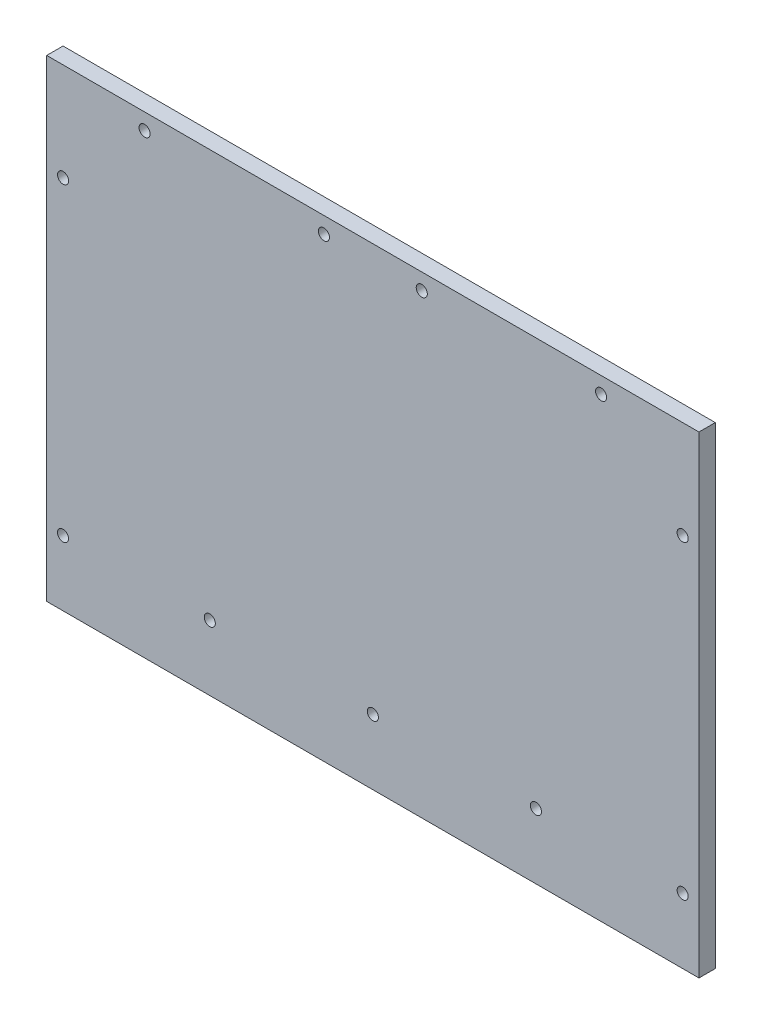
ISO-10303-21;
HEADER;
FILE_DESCRIPTION(('STEP AP214'),'2;1');
FILE_NAME('part.step','',(''),(''),'','','');
FILE_SCHEMA(('AUTOMOTIVE_DESIGN { 1 0 10303 214 1 1 1 1 }'));
ENDSEC;
DATA;
#1=APPLICATION_CONTEXT('core data for automotive mechanical design processes');
#2=APPLICATION_PROTOCOL_DEFINITION('international standard','automotive_design',2000,#1);
#3=PRODUCT_CONTEXT('',#1,'mechanical');
#4=PRODUCT('Part','Part','',(#3));
#5=PRODUCT_RELATED_PRODUCT_CATEGORY('part','',(#4));
#6=PRODUCT_DEFINITION_FORMATION('','',#4);
#7=PRODUCT_DEFINITION_CONTEXT('part definition',#1,'design');
#8=PRODUCT_DEFINITION('design','',#6,#7);
#9=PRODUCT_DEFINITION_SHAPE('','',#8);
#10=(LENGTH_UNIT() NAMED_UNIT(*) SI_UNIT(.MILLI.,.METRE.));
#11=(NAMED_UNIT(*) PLANE_ANGLE_UNIT() SI_UNIT($,.RADIAN.));
#12=(NAMED_UNIT(*) SI_UNIT($,.STERADIAN.) SOLID_ANGLE_UNIT());
#13=UNCERTAINTY_MEASURE_WITH_UNIT(LENGTH_MEASURE(1.E-05),#10,'distance_accuracy_value','');
#14=(GEOMETRIC_REPRESENTATION_CONTEXT(3) GLOBAL_UNCERTAINTY_ASSIGNED_CONTEXT((#13)) GLOBAL_UNIT_ASSIGNED_CONTEXT((#10,
#11,#12)) REPRESENTATION_CONTEXT('',''));
#15=CARTESIAN_POINT('',(0.,0.,0.));
#16=DIRECTION('',(0.,0.,1.));
#17=DIRECTION('',(1.,0.,0.));
#18=AXIS2_PLACEMENT_3D('',#15,#16,#17);
#19=CARTESIAN_POINT('',(0.,0.,0.));
#20=DIRECTION('',(0.,0.,1.));
#21=DIRECTION('',(1.,0.,0.));
#22=AXIS2_PLACEMENT_3D('',#19,#20,#21);
#23=PLANE('',#22);
#24=CARTESIAN_POINT('',(95.,42.5,0.));
#25=DIRECTION('',(0.,0.,-1.));
#26=DIRECTION('',(-1.,0.,0.));
#27=AXIS2_PLACEMENT_3D('',#24,#25,#26);
#28=CIRCLE('',#27,3.3);
#29=CARTESIAN_POINT('',(91.7,42.5,0.));
#30=VERTEX_POINT('',#29);
#31=EDGE_CURVE('E593',#30,#30,#28,.T.);
#32=ORIENTED_EDGE('',*,*,#31,.F.);
#33=EDGE_LOOP('',(#32));
#34=FACE_BOUND('',#33,.T.);
#35=CARTESIAN_POINT('',(-95.,42.5,0.));
#36=DIRECTION('',(0.,0.,-1.));
#37=DIRECTION('',(-1.,0.,0.));
#38=AXIS2_PLACEMENT_3D('',#35,#36,#37);
#39=CIRCLE('',#38,3.3);
#40=CARTESIAN_POINT('',(-98.3,42.5,0.));
#41=VERTEX_POINT('',#40);
#42=EDGE_CURVE('E584',#41,#41,#39,.T.);
#43=ORIENTED_EDGE('',*,*,#42,.F.);
#44=EDGE_LOOP('',(#43));
#45=FACE_BOUND('',#44,.T.);
#46=CARTESIAN_POINT('',(50.,-52.5,0.));
#47=DIRECTION('',(0.,0.,-1.));
#48=DIRECTION('',(-1.,0.,0.));
#49=AXIS2_PLACEMENT_3D('',#46,#47,#48);
#50=CIRCLE('',#49,3.3);
#51=CARTESIAN_POINT('',(46.7,-52.5,0.));
#52=VERTEX_POINT('',#51);
#53=EDGE_CURVE('E574',#52,#52,#50,.T.);
#54=ORIENTED_EDGE('',*,*,#53,.F.);
#55=EDGE_LOOP('',(#54));
#56=FACE_BOUND('',#55,.T.);
#57=CARTESIAN_POINT('',(0.,-52.5,0.));
#58=DIRECTION('',(0.,0.,-1.));
#59=DIRECTION('',(-1.,0.,0.));
#60=AXIS2_PLACEMENT_3D('',#57,#58,#59);
#61=CIRCLE('',#60,3.3);
#62=CARTESIAN_POINT('',(-3.30000000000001,-52.5,0.));
#63=VERTEX_POINT('',#62);
#64=EDGE_CURVE('E156',#63,#63,#61,.T.);
#65=ORIENTED_EDGE('',*,*,#64,.F.);
#66=EDGE_LOOP('',(#65));
#67=FACE_BOUND('',#66,.T.);
#68=CARTESIAN_POINT('',(-50.,-52.5,0.));
#69=DIRECTION('',(0.,0.,-1.));
#70=DIRECTION('',(-1.,0.,0.));
#71=AXIS2_PLACEMENT_3D('',#68,#69,#70);
#72=CIRCLE('',#71,3.3);
#73=CARTESIAN_POINT('',(-53.3,-52.5,0.));
#74=VERTEX_POINT('',#73);
#75=EDGE_CURVE('E149',#74,#74,#72,.T.);
#76=ORIENTED_EDGE('',*,*,#75,.F.);
#77=EDGE_LOOP('',(#76));
#78=FACE_BOUND('',#77,.T.);
#79=CARTESIAN_POINT('',(70.,67.5,0.));
#80=DIRECTION('',(0.,0.,-1.));
#81=DIRECTION('',(-1.,0.,0.));
#82=AXIS2_PLACEMENT_3D('',#79,#80,#81);
#83=CIRCLE('',#82,3.3);
#84=CARTESIAN_POINT('',(66.7,67.5,0.));
#85=VERTEX_POINT('',#84);
#86=EDGE_CURVE('E145',#85,#85,#83,.T.);
#87=ORIENTED_EDGE('',*,*,#86,.F.);
#88=EDGE_LOOP('',(#87));
#89=FACE_BOUND('',#88,.T.);
#90=CARTESIAN_POINT('',(-70.,67.5,0.));
#91=DIRECTION('',(0.,0.,-1.));
#92=DIRECTION('',(-1.,0.,0.));
#93=AXIS2_PLACEMENT_3D('',#90,#91,#92);
#94=CIRCLE('',#93,3.3);
#95=CARTESIAN_POINT('',(-73.3,67.5,0.));
#96=VERTEX_POINT('',#95);
#97=EDGE_CURVE('E141',#96,#96,#94,.T.);
#98=ORIENTED_EDGE('',*,*,#97,.F.);
#99=EDGE_LOOP('',(#98));
#100=FACE_BOUND('',#99,.T.);
#101=CARTESIAN_POINT('',(95.,-52.5,0.));
#102=DIRECTION('',(0.,0.,-1.));
#103=DIRECTION('',(-1.,0.,0.));
#104=AXIS2_PLACEMENT_3D('',#101,#102,#103);
#105=CIRCLE('',#104,3.3);
#106=CARTESIAN_POINT('',(91.7,-52.5,0.));
#107=VERTEX_POINT('',#106);
#108=EDGE_CURVE('E136',#107,#107,#105,.T.);
#109=ORIENTED_EDGE('',*,*,#108,.F.);
#110=EDGE_LOOP('',(#109));
#111=FACE_BOUND('',#110,.T.);
#112=CARTESIAN_POINT('',(-95.,-52.5,0.));
#113=DIRECTION('',(0.,0.,-1.));
#114=DIRECTION('',(-1.,0.,0.));
#115=AXIS2_PLACEMENT_3D('',#112,#113,#114);
#116=CIRCLE('',#115,3.3);
#117=CARTESIAN_POINT('',(-98.3,-52.5,0.));
#118=VERTEX_POINT('',#117);
#119=EDGE_CURVE('E131',#118,#118,#116,.T.);
#120=ORIENTED_EDGE('',*,*,#119,.F.);
#121=EDGE_LOOP('',(#120));
#122=FACE_BOUND('',#121,.T.);
#123=CARTESIAN_POINT('',(-15.,67.5,0.));
#124=DIRECTION('',(0.,0.,-1.));
#125=DIRECTION('',(-1.,0.,0.));
#126=AXIS2_PLACEMENT_3D('',#123,#124,#125);
#127=CIRCLE('',#126,3.3);
#128=CARTESIAN_POINT('',(-18.3,67.5,0.));
#129=VERTEX_POINT('',#128);
#130=EDGE_CURVE('E121',#129,#129,#127,.T.);
#131=ORIENTED_EDGE('',*,*,#130,.F.);
#132=EDGE_LOOP('',(#131));
#133=FACE_BOUND('',#132,.T.);
#134=DIRECTION('',(0.,1.,0.));
#135=VECTOR('',#134,1.);
#136=CARTESIAN_POINT('',(100.,72.5,0.));
#137=LINE('',#136,#135);
#138=CARTESIAN_POINT('',(100.,-72.5,0.));
#139=VERTEX_POINT('',#138);
#140=CARTESIAN_POINT('',(100.,72.5,0.));
#141=VERTEX_POINT('',#140);
#142=EDGE_CURVE('E106',#139,#141,#137,.T.);
#143=ORIENTED_EDGE('',*,*,#142,.F.);
#144=DIRECTION('',(1.,0.,0.));
#145=VECTOR('',#144,1.);
#146=CARTESIAN_POINT('',(-100.,-72.5,0.));
#147=LINE('',#146,#145);
#148=CARTESIAN_POINT('',(-100.,-72.5,0.));
#149=VERTEX_POINT('',#148);
#150=EDGE_CURVE('E81',#149,#139,#147,.T.);
#151=ORIENTED_EDGE('',*,*,#150,.F.);
#152=DIRECTION('',(0.,-1.,0.));
#153=VECTOR('',#152,1.);
#154=CARTESIAN_POINT('',(-100.,72.5,0.));
#155=LINE('',#154,#153);
#156=CARTESIAN_POINT('',(-100.,72.5,0.));
#157=VERTEX_POINT('',#156);
#158=EDGE_CURVE('E75',#157,#149,#155,.T.);
#159=ORIENTED_EDGE('',*,*,#158,.F.);
#160=DIRECTION('',(-1.,0.,0.));
#161=VECTOR('',#160,1.);
#162=CARTESIAN_POINT('',(-100.,72.5,0.));
#163=LINE('',#162,#161);
#164=EDGE_CURVE('E97',#141,#157,#163,.T.);
#165=ORIENTED_EDGE('',*,*,#164,.F.);
#166=EDGE_LOOP('',(#143,#151,#159,#165));
#167=FACE_BOUND('',#166,.T.);
#168=CARTESIAN_POINT('',(15.,67.5,0.));
#169=DIRECTION('',(0.,0.,-1.));
#170=DIRECTION('',(-1.,0.,0.));
#171=AXIS2_PLACEMENT_3D('',#168,#169,#170);
#172=CIRCLE('',#171,3.3);
#173=CARTESIAN_POINT('',(11.7,67.5,0.));
#174=VERTEX_POINT('',#173);
#175=EDGE_CURVE('E126',#174,#174,#172,.T.);
#176=ORIENTED_EDGE('',*,*,#175,.F.);
#177=EDGE_LOOP('',(#176));
#178=FACE_BOUND('',#177,.T.);
#179=ADVANCED_FACE('F39',(#34,#45,#56,#67,#78,#89,#100,#111,#122,#133,#167,#178),#23,.F.);
#180=CARTESIAN_POINT('',(100.,72.5,5.));
#181=DIRECTION('',(-1.,0.,0.));
#182=DIRECTION('',(0.,0.,1.));
#183=AXIS2_PLACEMENT_3D('',#180,#181,#182);
#184=PLANE('',#183);
#185=ORIENTED_EDGE('',*,*,#142,.T.);
#186=DIRECTION('',(0.,0.,-1.));
#187=VECTOR('',#186,1.);
#188=CARTESIAN_POINT('',(100.,72.5,5.));
#189=LINE('',#188,#187);
#190=CARTESIAN_POINT('',(100.,72.5,5.));
#191=VERTEX_POINT('',#190);
#192=EDGE_CURVE('E11',#191,#141,#189,.T.);
#193=ORIENTED_EDGE('',*,*,#192,.F.);
#194=DIRECTION('',(0.,1.,0.));
#195=VECTOR('',#194,1.);
#196=CARTESIAN_POINT('',(100.,72.5,5.));
#197=LINE('',#196,#195);
#198=CARTESIAN_POINT('',(100.,-72.5,5.));
#199=VERTEX_POINT('',#198);
#200=EDGE_CURVE('E93',#199,#191,#197,.T.);
#201=ORIENTED_EDGE('',*,*,#200,.F.);
#202=DIRECTION('',(0.,0.,-1.));
#203=VECTOR('',#202,1.);
#204=CARTESIAN_POINT('',(100.,-72.5,5.));
#205=LINE('',#204,#203);
#206=EDGE_CURVE('E102',#199,#139,#205,.T.);
#207=ORIENTED_EDGE('',*,*,#206,.T.);
#208=EDGE_LOOP('',(#185,#193,#201,#207));
#209=FACE_BOUND('',#208,.T.);
#210=ADVANCED_FACE('F41',(#209),#184,.F.);
#211=CARTESIAN_POINT('',(-100.,72.5,5.));
#212=DIRECTION('',(0.,-1.,0.));
#213=DIRECTION('',(0.,0.,-1.));
#214=AXIS2_PLACEMENT_3D('',#211,#212,#213);
#215=PLANE('',#214);
#216=ORIENTED_EDGE('',*,*,#164,.T.);
#217=DIRECTION('',(0.,0.,-1.));
#218=VECTOR('',#217,1.);
#219=CARTESIAN_POINT('',(-100.,72.5,5.));
#220=LINE('',#219,#218);
#221=CARTESIAN_POINT('',(-100.,72.5,5.));
#222=VERTEX_POINT('',#221);
#223=EDGE_CURVE('E49',#222,#157,#220,.T.);
#224=ORIENTED_EDGE('',*,*,#223,.F.);
#225=DIRECTION('',(-1.,0.,0.));
#226=VECTOR('',#225,1.);
#227=CARTESIAN_POINT('',(-100.,72.5,5.));
#228=LINE('',#227,#226);
#229=EDGE_CURVE('E88',#191,#222,#228,.T.);
#230=ORIENTED_EDGE('',*,*,#229,.F.);
#231=ORIENTED_EDGE('',*,*,#192,.T.);
#232=EDGE_LOOP('',(#216,#224,#230,#231));
#233=FACE_BOUND('',#232,.T.);
#234=ADVANCED_FACE('F96',(#233),#215,.F.);
#235=CARTESIAN_POINT('',(-100.,72.5,5.));
#236=DIRECTION('',(1.,0.,0.));
#237=DIRECTION('',(0.,1.,0.));
#238=AXIS2_PLACEMENT_3D('',#235,#236,#237);
#239=PLANE('',#238);
#240=ORIENTED_EDGE('',*,*,#158,.T.);
#241=DIRECTION('',(0.,0.,-1.));
#242=VECTOR('',#241,1.);
#243=CARTESIAN_POINT('',(-100.,-72.5,5.));
#244=LINE('',#243,#242);
#245=CARTESIAN_POINT('',(-100.,-72.5,5.));
#246=VERTEX_POINT('',#245);
#247=EDGE_CURVE('E98',#246,#149,#244,.T.);
#248=ORIENTED_EDGE('',*,*,#247,.F.);
#249=DIRECTION('',(0.,-1.,0.));
#250=VECTOR('',#249,1.);
#251=CARTESIAN_POINT('',(-100.,72.5,5.));
#252=LINE('',#251,#250);
#253=EDGE_CURVE('E91',#222,#246,#252,.T.);
#254=ORIENTED_EDGE('',*,*,#253,.F.);
#255=ORIENTED_EDGE('',*,*,#223,.T.);
#256=EDGE_LOOP('',(#240,#248,#254,#255));
#257=FACE_BOUND('',#256,.T.);
#258=ADVANCED_FACE('F100',(#257),#239,.F.);
#259=CARTESIAN_POINT('',(-100.,-72.5,5.));
#260=DIRECTION('',(0.,1.,0.));
#261=DIRECTION('',(0.,0.,1.));
#262=AXIS2_PLACEMENT_3D('',#259,#260,#261);
#263=PLANE('',#262);
#264=ORIENTED_EDGE('',*,*,#150,.T.);
#265=ORIENTED_EDGE('',*,*,#206,.F.);
#266=DIRECTION('',(1.,0.,0.));
#267=VECTOR('',#266,1.);
#268=CARTESIAN_POINT('',(-100.,-72.5,5.));
#269=LINE('',#268,#267);
#270=EDGE_CURVE('E58',#246,#199,#269,.T.);
#271=ORIENTED_EDGE('',*,*,#270,.F.);
#272=ORIENTED_EDGE('',*,*,#247,.T.);
#273=EDGE_LOOP('',(#264,#265,#271,#272));
#274=FACE_BOUND('',#273,.T.);
#275=ADVANCED_FACE('F229',(#274),#263,.F.);
#276=CARTESIAN_POINT('',(0.,0.,5.));
#277=DIRECTION('',(0.,0.,1.));
#278=DIRECTION('',(1.,0.,0.));
#279=AXIS2_PLACEMENT_3D('',#276,#277,#278);
#280=PLANE('',#279);
#281=CARTESIAN_POINT('',(95.,42.5,5.));
#282=DIRECTION('',(0.,0.,-1.));
#283=DIRECTION('',(-1.,0.,0.));
#284=AXIS2_PLACEMENT_3D('',#281,#282,#283);
#285=CIRCLE('',#284,1.69999999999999);
#286=CARTESIAN_POINT('',(93.3,42.5,5.));
#287=VERTEX_POINT('',#286);
#288=EDGE_CURVE('E587',#287,#287,#285,.T.);
#289=ORIENTED_EDGE('',*,*,#288,.T.);
#290=EDGE_LOOP('',(#289));
#291=FACE_BOUND('',#290,.T.);
#292=CARTESIAN_POINT('',(-95.,42.5,5.));
#293=DIRECTION('',(0.,0.,-1.));
#294=DIRECTION('',(-1.,0.,0.));
#295=AXIS2_PLACEMENT_3D('',#292,#293,#294);
#296=CIRCLE('',#295,1.69999999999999);
#297=CARTESIAN_POINT('',(-96.7,42.5,5.));
#298=VERTEX_POINT('',#297);
#299=EDGE_CURVE('E576',#298,#298,#296,.T.);
#300=ORIENTED_EDGE('',*,*,#299,.T.);
#301=EDGE_LOOP('',(#300));
#302=FACE_BOUND('',#301,.T.);
#303=CARTESIAN_POINT('',(50.,-52.5,5.));
#304=DIRECTION('',(0.,0.,1.));
#305=DIRECTION('',(1.,0.,0.));
#306=AXIS2_PLACEMENT_3D('',#303,#304,#305);
#307=CIRCLE('',#306,1.69999999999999);
#308=CARTESIAN_POINT('',(51.7,-52.5,5.));
#309=VERTEX_POINT('',#308);
#310=EDGE_CURVE('E43',#309,#309,#307,.T.);
#311=ORIENTED_EDGE('',*,*,#310,.F.);
#312=EDGE_LOOP('',(#311));
#313=FACE_BOUND('',#312,.T.);
#314=CARTESIAN_POINT('',(0.,-52.5,5.));
#315=DIRECTION('',(0.,0.,1.));
#316=DIRECTION('',(1.,0.,0.));
#317=AXIS2_PLACEMENT_3D('',#314,#315,#316);
#318=CIRCLE('',#317,1.69999999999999);
#319=CARTESIAN_POINT('',(1.69999999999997,-52.5,5.));
#320=VERTEX_POINT('',#319);
#321=EDGE_CURVE('E147',#320,#320,#318,.T.);
#322=ORIENTED_EDGE('',*,*,#321,.F.);
#323=EDGE_LOOP('',(#322));
#324=FACE_BOUND('',#323,.T.);
#325=CARTESIAN_POINT('',(-50.,-52.5,5.));
#326=DIRECTION('',(0.,0.,1.));
#327=DIRECTION('',(1.,0.,0.));
#328=AXIS2_PLACEMENT_3D('',#325,#326,#327);
#329=CIRCLE('',#328,1.69999999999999);
#330=CARTESIAN_POINT('',(-48.3,-52.5,5.));
#331=VERTEX_POINT('',#330);
#332=EDGE_CURVE('E143',#331,#331,#329,.T.);
#333=ORIENTED_EDGE('',*,*,#332,.F.);
#334=EDGE_LOOP('',(#333));
#335=FACE_BOUND('',#334,.T.);
#336=CARTESIAN_POINT('',(70.,67.5,5.));
#337=DIRECTION('',(0.,0.,1.));
#338=DIRECTION('',(1.,0.,0.));
#339=AXIS2_PLACEMENT_3D('',#336,#337,#338);
#340=CIRCLE('',#339,1.69999999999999);
#341=CARTESIAN_POINT('',(71.7,67.5,5.));
#342=VERTEX_POINT('',#341);
#343=EDGE_CURVE('E138',#342,#342,#340,.T.);
#344=ORIENTED_EDGE('',*,*,#343,.F.);
#345=EDGE_LOOP('',(#344));
#346=FACE_BOUND('',#345,.T.);
#347=CARTESIAN_POINT('',(-70.,67.5,5.));
#348=DIRECTION('',(0.,0.,1.));
#349=DIRECTION('',(1.,0.,0.));
#350=AXIS2_PLACEMENT_3D('',#347,#348,#349);
#351=CIRCLE('',#350,1.69999999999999);
#352=CARTESIAN_POINT('',(-68.3,67.5,5.));
#353=VERTEX_POINT('',#352);
#354=EDGE_CURVE('E133',#353,#353,#351,.T.);
#355=ORIENTED_EDGE('',*,*,#354,.F.);
#356=EDGE_LOOP('',(#355));
#357=FACE_BOUND('',#356,.T.);
#358=CARTESIAN_POINT('',(95.,-52.5,5.));
#359=DIRECTION('',(0.,0.,1.));
#360=DIRECTION('',(1.,0.,0.));
#361=AXIS2_PLACEMENT_3D('',#358,#359,#360);
#362=CIRCLE('',#361,1.69999999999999);
#363=CARTESIAN_POINT('',(96.7,-52.5,5.));
#364=VERTEX_POINT('',#363);
#365=EDGE_CURVE('E128',#364,#364,#362,.T.);
#366=ORIENTED_EDGE('',*,*,#365,.F.);
#367=EDGE_LOOP('',(#366));
#368=FACE_BOUND('',#367,.T.);
#369=CARTESIAN_POINT('',(-95.,-52.5,5.));
#370=DIRECTION('',(0.,0.,1.));
#371=DIRECTION('',(1.,0.,0.));
#372=AXIS2_PLACEMENT_3D('',#369,#370,#371);
#373=CIRCLE('',#372,1.69999999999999);
#374=CARTESIAN_POINT('',(-93.3,-52.5,5.));
#375=VERTEX_POINT('',#374);
#376=EDGE_CURVE('E123',#375,#375,#373,.T.);
#377=ORIENTED_EDGE('',*,*,#376,.F.);
#378=EDGE_LOOP('',(#377));
#379=FACE_BOUND('',#378,.T.);
#380=CARTESIAN_POINT('',(15.,67.5,5.));
#381=DIRECTION('',(0.,0.,1.));
#382=DIRECTION('',(1.,0.,0.));
#383=AXIS2_PLACEMENT_3D('',#380,#381,#382);
#384=CIRCLE('',#383,1.69999999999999);
#385=CARTESIAN_POINT('',(16.7,67.5,5.));
#386=VERTEX_POINT('',#385);
#387=EDGE_CURVE('E118',#386,#386,#384,.T.);
#388=ORIENTED_EDGE('',*,*,#387,.F.);
#389=EDGE_LOOP('',(#388));
#390=FACE_BOUND('',#389,.T.);
#391=CARTESIAN_POINT('',(-15.,67.5,5.));
#392=DIRECTION('',(0.,0.,1.));
#393=DIRECTION('',(1.,0.,0.));
#394=AXIS2_PLACEMENT_3D('',#391,#392,#393);
#395=CIRCLE('',#394,1.69999999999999);
#396=CARTESIAN_POINT('',(-13.3,67.5,5.));
#397=VERTEX_POINT('',#396);
#398=EDGE_CURVE('E109',#397,#397,#395,.T.);
#399=ORIENTED_EDGE('',*,*,#398,.F.);
#400=EDGE_LOOP('',(#399));
#401=FACE_BOUND('',#400,.T.);
#402=ORIENTED_EDGE('',*,*,#200,.T.);
#403=ORIENTED_EDGE('',*,*,#229,.T.);
#404=ORIENTED_EDGE('',*,*,#253,.T.);
#405=ORIENTED_EDGE('',*,*,#270,.T.);
#406=EDGE_LOOP('',(#402,#403,#404,#405));
#407=FACE_BOUND('',#406,.T.);
#408=ADVANCED_FACE('F89',(#291,#302,#313,#324,#335,#346,#357,#368,#379,#390,#401,#407),#280,.T.);
#409=CARTESIAN_POINT('',(-15.,67.5,0.));
#410=DIRECTION('',(0.,0.,-1.));
#411=DIRECTION('',(-1.,0.,0.));
#412=AXIS2_PLACEMENT_3D('',#409,#410,#411);
#413=CYLINDRICAL_SURFACE('',#412,1.69999999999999);
#414=ORIENTED_EDGE('',*,*,#398,.T.);
#415=EDGE_LOOP('',(#414));
#416=FACE_BOUND('',#415,.T.);
#417=CARTESIAN_POINT('',(-15.,67.5,1.60000000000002));
#418=DIRECTION('',(0.,0.,-1.));
#419=DIRECTION('',(-1.,0.,0.));
#420=AXIS2_PLACEMENT_3D('',#417,#418,#419);
#421=CIRCLE('',#420,1.69999999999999);
#422=CARTESIAN_POINT('',(-16.7,67.5,1.60000000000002));
#423=VERTEX_POINT('',#422);
#424=EDGE_CURVE('E117',#423,#423,#421,.T.);
#425=ORIENTED_EDGE('',*,*,#424,.T.);
#426=EDGE_LOOP('',(#425));
#427=FACE_BOUND('',#426,.T.);
#428=ADVANCED_FACE('F191',(#416,#427),#413,.F.);
#429=CARTESIAN_POINT('',(-15.,67.5,0.));
#430=DIRECTION('',(0.,0.,-1.));
#431=DIRECTION('',(-1.,0.,0.));
#432=AXIS2_PLACEMENT_3D('',#429,#430,#431);
#433=CONICAL_SURFACE('',#432,3.3,0.785398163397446);
#434=ORIENTED_EDGE('',*,*,#424,.F.);
#435=EDGE_LOOP('',(#434));
#436=FACE_BOUND('',#435,.T.);
#437=ORIENTED_EDGE('',*,*,#130,.T.);
#438=EDGE_LOOP('',(#437));
#439=FACE_BOUND('',#438,.T.);
#440=ADVANCED_FACE('F193',(#436,#439),#433,.F.);
#441=CARTESIAN_POINT('',(15.,67.5,0.));
#442=DIRECTION('',(0.,0.,-1.));
#443=DIRECTION('',(-1.,0.,0.));
#444=AXIS2_PLACEMENT_3D('',#441,#442,#443);
#445=CYLINDRICAL_SURFACE('',#444,1.69999999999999);
#446=ORIENTED_EDGE('',*,*,#387,.T.);
#447=EDGE_LOOP('',(#446));
#448=FACE_BOUND('',#447,.T.);
#449=CARTESIAN_POINT('',(15.,67.5,1.60000000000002));
#450=DIRECTION('',(0.,0.,-1.));
#451=DIRECTION('',(-1.,0.,0.));
#452=AXIS2_PLACEMENT_3D('',#449,#450,#451);
#453=CIRCLE('',#452,1.69999999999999);
#454=CARTESIAN_POINT('',(13.3,67.5,1.60000000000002));
#455=VERTEX_POINT('',#454);
#456=EDGE_CURVE('E122',#455,#455,#453,.T.);
#457=ORIENTED_EDGE('',*,*,#456,.T.);
#458=EDGE_LOOP('',(#457));
#459=FACE_BOUND('',#458,.T.);
#460=ADVANCED_FACE('F196',(#448,#459),#445,.F.);
#461=CARTESIAN_POINT('',(15.,67.5,0.));
#462=DIRECTION('',(0.,0.,-1.));
#463=DIRECTION('',(-1.,0.,0.));
#464=AXIS2_PLACEMENT_3D('',#461,#462,#463);
#465=CONICAL_SURFACE('',#464,3.3,0.785398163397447);
#466=ORIENTED_EDGE('',*,*,#456,.F.);
#467=EDGE_LOOP('',(#466));
#468=FACE_BOUND('',#467,.T.);
#469=ORIENTED_EDGE('',*,*,#175,.T.);
#470=EDGE_LOOP('',(#469));
#471=FACE_BOUND('',#470,.T.);
#472=ADVANCED_FACE('F208',(#468,#471),#465,.F.);
#473=CARTESIAN_POINT('',(-95.,-52.5,0.));
#474=DIRECTION('',(0.,0.,-1.));
#475=DIRECTION('',(-1.,0.,0.));
#476=AXIS2_PLACEMENT_3D('',#473,#474,#475);
#477=CYLINDRICAL_SURFACE('',#476,1.69999999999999);
#478=ORIENTED_EDGE('',*,*,#376,.T.);
#479=EDGE_LOOP('',(#478));
#480=FACE_BOUND('',#479,.T.);
#481=CARTESIAN_POINT('',(-95.,-52.5,1.60000000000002));
#482=DIRECTION('',(0.,0.,-1.));
#483=DIRECTION('',(-1.,0.,0.));
#484=AXIS2_PLACEMENT_3D('',#481,#482,#483);
#485=CIRCLE('',#484,1.69999999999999);
#486=CARTESIAN_POINT('',(-96.7,-52.5,1.60000000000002));
#487=VERTEX_POINT('',#486);
#488=EDGE_CURVE('E127',#487,#487,#485,.T.);
#489=ORIENTED_EDGE('',*,*,#488,.T.);
#490=EDGE_LOOP('',(#489));
#491=FACE_BOUND('',#490,.T.);
#492=ADVANCED_FACE('F210',(#480,#491),#477,.F.);
#493=CARTESIAN_POINT('',(-95.,-52.5,0.));
#494=DIRECTION('',(0.,0.,-1.));
#495=DIRECTION('',(-1.,0.,0.));
#496=AXIS2_PLACEMENT_3D('',#493,#494,#495);
#497=CONICAL_SURFACE('',#496,3.3,0.785398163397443);
#498=ORIENTED_EDGE('',*,*,#488,.F.);
#499=EDGE_LOOP('',(#498));
#500=FACE_BOUND('',#499,.T.);
#501=ORIENTED_EDGE('',*,*,#119,.T.);
#502=EDGE_LOOP('',(#501));
#503=FACE_BOUND('',#502,.T.);
#504=ADVANCED_FACE('F217',(#500,#503),#497,.F.);
#505=CARTESIAN_POINT('',(95.,-52.5,0.));
#506=DIRECTION('',(0.,0.,-1.));
#507=DIRECTION('',(-1.,0.,0.));
#508=AXIS2_PLACEMENT_3D('',#505,#506,#507);
#509=CYLINDRICAL_SURFACE('',#508,1.69999999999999);
#510=ORIENTED_EDGE('',*,*,#365,.T.);
#511=EDGE_LOOP('',(#510));
#512=FACE_BOUND('',#511,.T.);
#513=CARTESIAN_POINT('',(95.,-52.5,1.60000000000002));
#514=DIRECTION('',(0.,0.,-1.));
#515=DIRECTION('',(-1.,0.,0.));
#516=AXIS2_PLACEMENT_3D('',#513,#514,#515);
#517=CIRCLE('',#516,1.69999999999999);
#518=CARTESIAN_POINT('',(93.3,-52.5,1.60000000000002));
#519=VERTEX_POINT('',#518);
#520=EDGE_CURVE('E132',#519,#519,#517,.T.);
#521=ORIENTED_EDGE('',*,*,#520,.T.);
#522=EDGE_LOOP('',(#521));
#523=FACE_BOUND('',#522,.T.);
#524=ADVANCED_FACE('F413',(#512,#523),#509,.F.);
#525=CARTESIAN_POINT('',(95.,-52.5,0.));
#526=DIRECTION('',(0.,0.,-1.));
#527=DIRECTION('',(-1.,0.,0.));
#528=AXIS2_PLACEMENT_3D('',#525,#526,#527);
#529=CONICAL_SURFACE('',#528,3.3,0.785398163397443);
#530=ORIENTED_EDGE('',*,*,#520,.F.);
#531=EDGE_LOOP('',(#530));
#532=FACE_BOUND('',#531,.T.);
#533=ORIENTED_EDGE('',*,*,#108,.T.);
#534=EDGE_LOOP('',(#533));
#535=FACE_BOUND('',#534,.T.);
#536=ADVANCED_FACE('F403',(#532,#535),#529,.F.);
#537=CARTESIAN_POINT('',(-70.,67.5,0.));
#538=DIRECTION('',(0.,0.,-1.));
#539=DIRECTION('',(-1.,0.,0.));
#540=AXIS2_PLACEMENT_3D('',#537,#538,#539);
#541=CYLINDRICAL_SURFACE('',#540,1.69999999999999);
#542=ORIENTED_EDGE('',*,*,#354,.T.);
#543=EDGE_LOOP('',(#542));
#544=FACE_BOUND('',#543,.T.);
#545=CARTESIAN_POINT('',(-70.,67.5,1.60000000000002));
#546=DIRECTION('',(0.,0.,-1.));
#547=DIRECTION('',(-1.,0.,0.));
#548=AXIS2_PLACEMENT_3D('',#545,#546,#547);
#549=CIRCLE('',#548,1.69999999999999);
#550=CARTESIAN_POINT('',(-71.7,67.5,1.60000000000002));
#551=VERTEX_POINT('',#550);
#552=EDGE_CURVE('E137',#551,#551,#549,.T.);
#553=ORIENTED_EDGE('',*,*,#552,.T.);
#554=EDGE_LOOP('',(#553));
#555=FACE_BOUND('',#554,.T.);
#556=ADVANCED_FACE('F393',(#544,#555),#541,.F.);
#557=CARTESIAN_POINT('',(-70.,67.5,0.));
#558=DIRECTION('',(0.,0.,-1.));
#559=DIRECTION('',(-1.,0.,0.));
#560=AXIS2_PLACEMENT_3D('',#557,#558,#559);
#561=CONICAL_SURFACE('',#560,3.3,0.785398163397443);
#562=ORIENTED_EDGE('',*,*,#552,.F.);
#563=EDGE_LOOP('',(#562));
#564=FACE_BOUND('',#563,.T.);
#565=ORIENTED_EDGE('',*,*,#97,.T.);
#566=EDGE_LOOP('',(#565));
#567=FACE_BOUND('',#566,.T.);
#568=ADVANCED_FACE('F383',(#564,#567),#561,.F.);
#569=CARTESIAN_POINT('',(70.,67.5,0.));
#570=DIRECTION('',(0.,0.,-1.));
#571=DIRECTION('',(-1.,0.,0.));
#572=AXIS2_PLACEMENT_3D('',#569,#570,#571);
#573=CYLINDRICAL_SURFACE('',#572,1.69999999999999);
#574=ORIENTED_EDGE('',*,*,#343,.T.);
#575=EDGE_LOOP('',(#574));
#576=FACE_BOUND('',#575,.T.);
#577=CARTESIAN_POINT('',(70.,67.5,1.60000000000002));
#578=DIRECTION('',(0.,0.,-1.));
#579=DIRECTION('',(-1.,0.,0.));
#580=AXIS2_PLACEMENT_3D('',#577,#578,#579);
#581=CIRCLE('',#580,1.69999999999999);
#582=CARTESIAN_POINT('',(68.3,67.5,1.60000000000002));
#583=VERTEX_POINT('',#582);
#584=EDGE_CURVE('E142',#583,#583,#581,.T.);
#585=ORIENTED_EDGE('',*,*,#584,.T.);
#586=EDGE_LOOP('',(#585));
#587=FACE_BOUND('',#586,.T.);
#588=ADVANCED_FACE('F373',(#576,#587),#573,.F.);
#589=CARTESIAN_POINT('',(70.,67.5,0.));
#590=DIRECTION('',(0.,0.,-1.));
#591=DIRECTION('',(-1.,0.,0.));
#592=AXIS2_PLACEMENT_3D('',#589,#590,#591);
#593=CONICAL_SURFACE('',#592,3.3,0.785398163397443);
#594=ORIENTED_EDGE('',*,*,#584,.F.);
#595=EDGE_LOOP('',(#594));
#596=FACE_BOUND('',#595,.T.);
#597=ORIENTED_EDGE('',*,*,#86,.T.);
#598=EDGE_LOOP('',(#597));
#599=FACE_BOUND('',#598,.T.);
#600=ADVANCED_FACE('F363',(#596,#599),#593,.F.);
#601=CARTESIAN_POINT('',(-50.,-52.5,0.));
#602=DIRECTION('',(0.,0.,-1.));
#603=DIRECTION('',(-1.,0.,0.));
#604=AXIS2_PLACEMENT_3D('',#601,#602,#603);
#605=CYLINDRICAL_SURFACE('',#604,1.69999999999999);
#606=ORIENTED_EDGE('',*,*,#332,.T.);
#607=EDGE_LOOP('',(#606));
#608=FACE_BOUND('',#607,.T.);
#609=CARTESIAN_POINT('',(-50.,-52.5,1.60000000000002));
#610=DIRECTION('',(0.,0.,-1.));
#611=DIRECTION('',(-1.,0.,0.));
#612=AXIS2_PLACEMENT_3D('',#609,#610,#611);
#613=CIRCLE('',#612,1.69999999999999);
#614=CARTESIAN_POINT('',(-51.7,-52.5,1.60000000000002));
#615=VERTEX_POINT('',#614);
#616=EDGE_CURVE('E146',#615,#615,#613,.T.);
#617=ORIENTED_EDGE('',*,*,#616,.T.);
#618=EDGE_LOOP('',(#617));
#619=FACE_BOUND('',#618,.T.);
#620=ADVANCED_FACE('F353',(#608,#619),#605,.F.);
#621=CARTESIAN_POINT('',(-50.,-52.5,0.));
#622=DIRECTION('',(0.,0.,-1.));
#623=DIRECTION('',(-1.,0.,0.));
#624=AXIS2_PLACEMENT_3D('',#621,#622,#623);
#625=CONICAL_SURFACE('',#624,3.3,0.785398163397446);
#626=ORIENTED_EDGE('',*,*,#616,.F.);
#627=EDGE_LOOP('',(#626));
#628=FACE_BOUND('',#627,.T.);
#629=ORIENTED_EDGE('',*,*,#75,.T.);
#630=EDGE_LOOP('',(#629));
#631=FACE_BOUND('',#630,.T.);
#632=ADVANCED_FACE('F344',(#628,#631),#625,.F.);
#633=CARTESIAN_POINT('',(0.,-52.5,0.));
#634=DIRECTION('',(0.,0.,-1.));
#635=DIRECTION('',(-1.,0.,0.));
#636=AXIS2_PLACEMENT_3D('',#633,#634,#635);
#637=CYLINDRICAL_SURFACE('',#636,1.69999999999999);
#638=ORIENTED_EDGE('',*,*,#321,.T.);
#639=EDGE_LOOP('',(#638));
#640=FACE_BOUND('',#639,.T.);
#641=CARTESIAN_POINT('',(0.,-52.5,1.60000000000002));
#642=DIRECTION('',(0.,0.,-1.));
#643=DIRECTION('',(-1.,0.,0.));
#644=AXIS2_PLACEMENT_3D('',#641,#642,#643);
#645=CIRCLE('',#644,1.69999999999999);
#646=CARTESIAN_POINT('',(-1.7,-52.5,1.60000000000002));
#647=VERTEX_POINT('',#646);
#648=EDGE_CURVE('E150',#647,#647,#645,.T.);
#649=ORIENTED_EDGE('',*,*,#648,.T.);
#650=EDGE_LOOP('',(#649));
#651=FACE_BOUND('',#650,.T.);
#652=ADVANCED_FACE('F334',(#640,#651),#637,.F.);
#653=CARTESIAN_POINT('',(0.,-52.5,0.));
#654=DIRECTION('',(0.,0.,-1.));
#655=DIRECTION('',(-1.,0.,0.));
#656=AXIS2_PLACEMENT_3D('',#653,#654,#655);
#657=CONICAL_SURFACE('',#656,3.3,0.785398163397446);
#658=ORIENTED_EDGE('',*,*,#648,.F.);
#659=EDGE_LOOP('',(#658));
#660=FACE_BOUND('',#659,.T.);
#661=ORIENTED_EDGE('',*,*,#64,.T.);
#662=EDGE_LOOP('',(#661));
#663=FACE_BOUND('',#662,.T.);
#664=ADVANCED_FACE('F325',(#660,#663),#657,.F.);
#665=CARTESIAN_POINT('',(50.,-52.5,0.));
#666=DIRECTION('',(0.,0.,-1.));
#667=DIRECTION('',(-1.,0.,0.));
#668=AXIS2_PLACEMENT_3D('',#665,#666,#667);
#669=CYLINDRICAL_SURFACE('',#668,1.69999999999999);
#670=ORIENTED_EDGE('',*,*,#310,.T.);
#671=EDGE_LOOP('',(#670));
#672=FACE_BOUND('',#671,.T.);
#673=CARTESIAN_POINT('',(50.,-52.5,1.60000000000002));
#674=DIRECTION('',(0.,0.,-1.));
#675=DIRECTION('',(-1.,0.,0.));
#676=AXIS2_PLACEMENT_3D('',#673,#674,#675);
#677=CIRCLE('',#676,1.69999999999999);
#678=CARTESIAN_POINT('',(48.3,-52.5,1.60000000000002));
#679=VERTEX_POINT('',#678);
#680=EDGE_CURVE('E573',#679,#679,#677,.T.);
#681=ORIENTED_EDGE('',*,*,#680,.T.);
#682=EDGE_LOOP('',(#681));
#683=FACE_BOUND('',#682,.T.);
#684=ADVANCED_FACE('F316',(#672,#683),#669,.F.);
#685=CARTESIAN_POINT('',(50.,-52.5,0.));
#686=DIRECTION('',(0.,0.,-1.));
#687=DIRECTION('',(-1.,0.,0.));
#688=AXIS2_PLACEMENT_3D('',#685,#686,#687);
#689=CONICAL_SURFACE('',#688,3.3,0.785398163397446);
#690=ORIENTED_EDGE('',*,*,#680,.F.);
#691=EDGE_LOOP('',(#690));
#692=FACE_BOUND('',#691,.T.);
#693=ORIENTED_EDGE('',*,*,#53,.T.);
#694=EDGE_LOOP('',(#693));
#695=FACE_BOUND('',#694,.T.);
#696=ADVANCED_FACE('F254',(#692,#695),#689,.F.);
#697=CARTESIAN_POINT('',(-95.,42.5,0.));
#698=DIRECTION('',(0.,0.,-1.));
#699=DIRECTION('',(-1.,0.,0.));
#700=AXIS2_PLACEMENT_3D('',#697,#698,#699);
#701=CYLINDRICAL_SURFACE('',#700,1.69999999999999);
#702=ORIENTED_EDGE('',*,*,#299,.F.);
#703=EDGE_LOOP('',(#702));
#704=FACE_BOUND('',#703,.T.);
#705=CARTESIAN_POINT('',(-95.,42.5,1.6));
#706=DIRECTION('',(0.,0.,-1.));
#707=DIRECTION('',(-1.,0.,0.));
#708=AXIS2_PLACEMENT_3D('',#705,#706,#707);
#709=CIRCLE('',#708,1.69999999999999);
#710=CARTESIAN_POINT('',(-96.7,42.5,1.6));
#711=VERTEX_POINT('',#710);
#712=EDGE_CURVE('E581',#711,#711,#709,.T.);
#713=ORIENTED_EDGE('',*,*,#712,.T.);
#714=EDGE_LOOP('',(#713));
#715=FACE_BOUND('',#714,.T.);
#716=ADVANCED_FACE('F266',(#704,#715),#701,.F.);
#717=CARTESIAN_POINT('',(-95.,42.5,0.));
#718=DIRECTION('',(0.,0.,-1.));
#719=DIRECTION('',(-1.,0.,0.));
#720=AXIS2_PLACEMENT_3D('',#717,#718,#719);
#721=CONICAL_SURFACE('',#720,3.3,0.785398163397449);
#722=ORIENTED_EDGE('',*,*,#712,.F.);
#723=EDGE_LOOP('',(#722));
#724=FACE_BOUND('',#723,.T.);
#725=ORIENTED_EDGE('',*,*,#42,.T.);
#726=EDGE_LOOP('',(#725));
#727=FACE_BOUND('',#726,.T.);
#728=ADVANCED_FACE('F271',(#724,#727),#721,.F.);
#729=CARTESIAN_POINT('',(95.,42.5,0.));
#730=DIRECTION('',(0.,0.,-1.));
#731=DIRECTION('',(-1.,0.,0.));
#732=AXIS2_PLACEMENT_3D('',#729,#730,#731);
#733=CYLINDRICAL_SURFACE('',#732,1.69999999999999);
#734=ORIENTED_EDGE('',*,*,#288,.F.);
#735=EDGE_LOOP('',(#734));
#736=FACE_BOUND('',#735,.T.);
#737=CARTESIAN_POINT('',(95.,42.5,1.6));
#738=DIRECTION('',(0.,0.,-1.));
#739=DIRECTION('',(-1.,0.,0.));
#740=AXIS2_PLACEMENT_3D('',#737,#738,#739);
#741=CIRCLE('',#740,1.69999999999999);
#742=CARTESIAN_POINT('',(93.3,42.5,1.6));
#743=VERTEX_POINT('',#742);
#744=EDGE_CURVE('E590',#743,#743,#741,.T.);
#745=ORIENTED_EDGE('',*,*,#744,.T.);
#746=EDGE_LOOP('',(#745));
#747=FACE_BOUND('',#746,.T.);
#748=ADVANCED_FACE('F282',(#736,#747),#733,.F.);
#749=CARTESIAN_POINT('',(95.,42.5,0.));
#750=DIRECTION('',(0.,0.,-1.));
#751=DIRECTION('',(-1.,0.,0.));
#752=AXIS2_PLACEMENT_3D('',#749,#750,#751);
#753=CONICAL_SURFACE('',#752,3.3,0.785398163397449);
#754=ORIENTED_EDGE('',*,*,#744,.F.);
#755=EDGE_LOOP('',(#754));
#756=FACE_BOUND('',#755,.T.);
#757=ORIENTED_EDGE('',*,*,#31,.T.);
#758=EDGE_LOOP('',(#757));
#759=FACE_BOUND('',#758,.T.);
#760=ADVANCED_FACE('F293',(#756,#759),#753,.F.);
#761=CLOSED_SHELL('',(#179,#210,#234,#258,#275,#408,#428,#440,#460,#472,#492,#504,#524,#536,
#556,#568,#588,#600,#620,#632,#652,#664,#684,#696,#716,#728,#748,#760));
#762=MANIFOLD_SOLID_BREP('B2',#761);
#763=ADVANCED_BREP_SHAPE_REPRESENTATION('',(#18,#762),#14);
#764=SHAPE_DEFINITION_REPRESENTATION(#9,#763);
ENDSEC;
END-ISO-10303-21;
